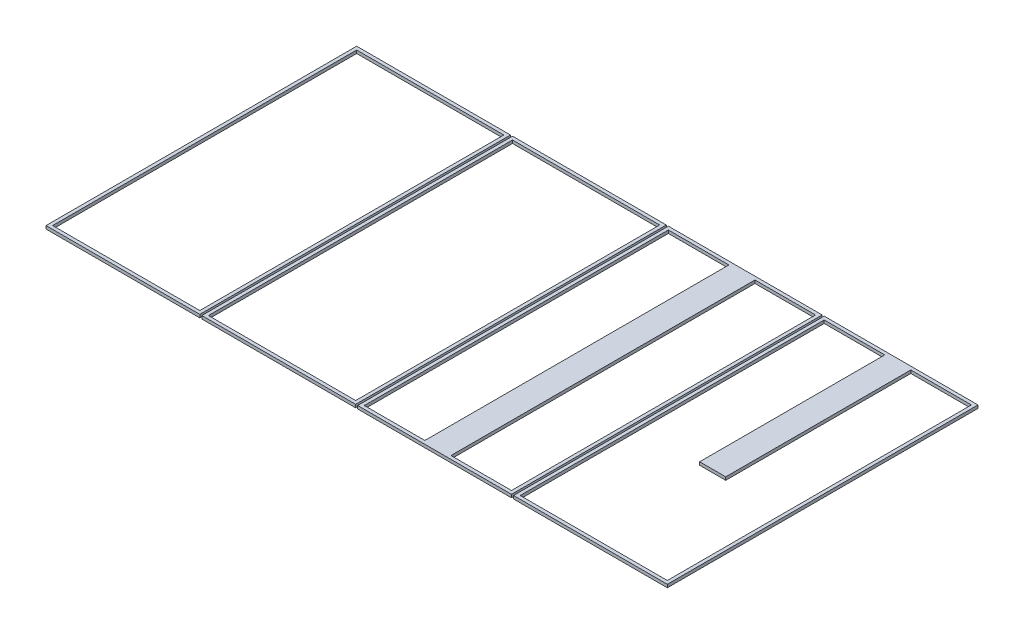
from build123d import *

# Parameters (mm, degrees)
SKETCH1_W            = 578
SKETCH1_H            = 1194
BOSS_EXTRU_1_DEPTH   = 12
BOSS_EXTRU_1_2_DEPTH = 12
BOSS_EXTRU_1_3_DEPTH = 12
BOSS_EXTRU_1_4_DEPTH = 12
SKETCH2_W            = 102.4
SKETCH2_H            = 1194
SKETCH2_H_2          = 726.9
BOSS_EXTRUDE1_DEPTH  = 12


with BuildPart() as part:
    # Sketch1 → Boss.-Extru.1 (new body)
    with BuildSketch(Plane(origin=(0, 0, 0), x_dir=(1, 0, 0), z_dir=(0, 1, 0))):
        Polygon((0, 0), (0, 1220), (604, 1220), (604, 0), (591, 0), (13, 0), align=None)
        with Locations((302, 610)):
            Rectangle(SKETCH1_W, SKETCH1_H, mode=Mode.SUBTRACT)
    extrude(amount=BOSS_EXTRU_1_DEPTH)


with BuildPart() as body_2:
    # Sketch1 → Boss.-Extru.1 2 (new body)
    with BuildSketch(Plane(origin=(0, 0, 0), x_dir=(1, 0, 0), z_dir=(0, 1, 0))):
        Polygon((2440, 0), (2440, 1220), (1836, 1220), (1836, 0), (1849, 0), (2427, 0), align=None)
        with Locations((2138, 610)):
            Rectangle(SKETCH1_W, SKETCH1_H, mode=Mode.SUBTRACT)
    extrude(amount=BOSS_EXTRU_1_2_DEPTH)



with BuildPart() as body_3:
    # Sketch1 → Boss.-Extru.1 3 (new body)
    with BuildSketch(Plane(origin=(0, 0, 0), x_dir=(1, 0, 0), z_dir=(0, 1, 0))):
        Polygon((625, 0), (1203, 0), (1216, 0), (1216, 1220), (612, 1220), (612, 0), align=None)
        with Locations((914, 610)):
            Rectangle(SKETCH1_W, SKETCH1_H, mode=Mode.SUBTRACT)
    extrude(amount=BOSS_EXTRU_1_3_DEPTH)


with BuildPart() as body_4:
    # Sketch1 → Boss.-Extru.1 4 (new body)
    with BuildSketch(Plane(origin=(0, 0, 0), x_dir=(1, 0, 0), z_dir=(0, 1, 0))):
        Polygon((1237, 0), (1815, 0), (1828, 0), (1828, 1220), (1224, 1220), (1224, 0), align=None)
        with Locations((1526, 610)):
            Rectangle(SKETCH1_W, SKETCH1_H, mode=Mode.SUBTRACT)
    extrude(amount=BOSS_EXTRU_1_4_DEPTH)


with BuildPart() as body_2_1:
    add(body_2.part)

    add(body_4.part)  # Boss-Extrude1 merges body 4
    # Sketch2 → Boss-Extrude1 (add)
    with BuildSketch(Plane(origin=(0, 0, 0), x_dir=(1, 0, 0), z_dir=(0, 1, 0))):
        with Locations((1526, 610)):
            Rectangle(SKETCH2_W, SKETCH2_H)
        with Locations((2138, 843.55)):
            Rectangle(SKETCH2_W, SKETCH2_H_2)
    extrude(amount=BOSS_EXTRUDE1_DEPTH)


solid = Compound([part.part, body_3.part, body_2_1.part])
